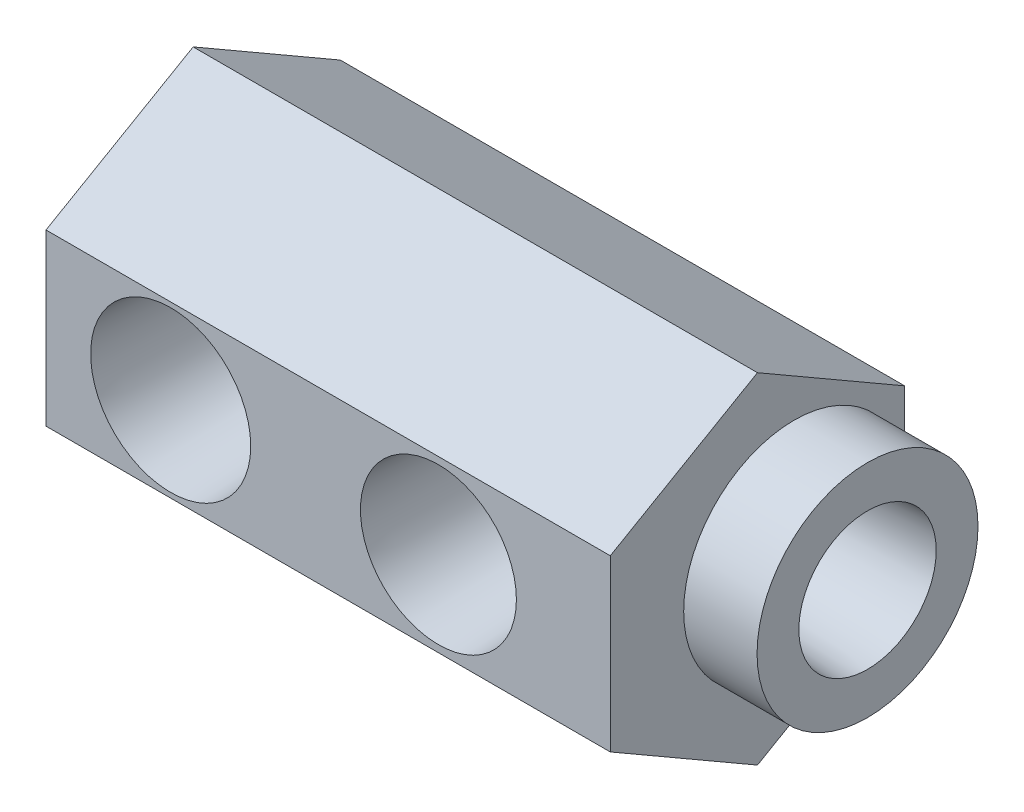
ISO-10303-21;
HEADER;
FILE_DESCRIPTION(('STEP AP214'),'2;1');
FILE_NAME('part.step','',(''),(''),'','','');
FILE_SCHEMA(('AUTOMOTIVE_DESIGN { 1 0 10303 214 1 1 1 1 }'));
ENDSEC;
DATA;
#1=APPLICATION_CONTEXT('core data for automotive mechanical design processes');
#2=APPLICATION_PROTOCOL_DEFINITION('international standard','automotive_design',2000,#1);
#3=PRODUCT_CONTEXT('',#1,'mechanical');
#4=PRODUCT('Part','Part','',(#3));
#5=PRODUCT_RELATED_PRODUCT_CATEGORY('part','',(#4));
#6=PRODUCT_DEFINITION_FORMATION('','',#4);
#7=PRODUCT_DEFINITION_CONTEXT('part definition',#1,'design');
#8=PRODUCT_DEFINITION('design','',#6,#7);
#9=PRODUCT_DEFINITION_SHAPE('','',#8);
#10=(LENGTH_UNIT() NAMED_UNIT(*) SI_UNIT(.MILLI.,.METRE.));
#11=(NAMED_UNIT(*) PLANE_ANGLE_UNIT() SI_UNIT($,.RADIAN.));
#12=(NAMED_UNIT(*) SI_UNIT($,.STERADIAN.) SOLID_ANGLE_UNIT());
#13=UNCERTAINTY_MEASURE_WITH_UNIT(LENGTH_MEASURE(1.E-05),#10,'distance_accuracy_value','');
#14=(GEOMETRIC_REPRESENTATION_CONTEXT(3) GLOBAL_UNCERTAINTY_ASSIGNED_CONTEXT((#13)) GLOBAL_UNIT_ASSIGNED_CONTEXT((#10,
#11,#12)) REPRESENTATION_CONTEXT('',''));
#15=CARTESIAN_POINT('',(0.,0.,0.));
#16=DIRECTION('',(0.,0.,1.));
#17=DIRECTION('',(1.,0.,0.));
#18=AXIS2_PLACEMENT_3D('',#15,#16,#17);
#19=CARTESIAN_POINT('',(23.270817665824,0.,7.8613));
#20=DIRECTION('',(-1.,0.,0.));
#21=DIRECTION('',(0.,0.,1.));
#22=AXIS2_PLACEMENT_3D('',#19,#20,#21);
#23=CYLINDRICAL_SURFACE('',#22,2.77749);
#24=CARTESIAN_POINT('',(21.3737276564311,-1.30506004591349,10.3130889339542));
#25=CARTESIAN_POINT('',(21.3973538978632,-1.37797775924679,10.2742739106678));
#26=CARTESIAN_POINT('',(21.4224908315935,-1.44874878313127,10.232430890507));
#27=CARTESIAN_POINT('',(21.4750745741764,-1.58567543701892,10.1431329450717));
#28=CARTESIAN_POINT('',(21.5025197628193,-1.65183424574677,10.0956819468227));
#29=CARTESIAN_POINT('',(21.5591046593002,-1.77945505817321,9.99544830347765));
#30=CARTESIAN_POINT('',(21.5882479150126,-1.84090655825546,9.94265431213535));
#31=CARTESIAN_POINT('',(21.6474375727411,-1.95874458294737,9.83216162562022));
#32=CARTESIAN_POINT('',(21.6774841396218,-2.01513017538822,9.77446203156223));
#33=CARTESIAN_POINT('',(21.7677217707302,-2.17616061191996,9.59468772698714));
#34=CARTESIAN_POINT('',(21.8281842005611,-2.27305299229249,9.4656422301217));
#35=CARTESIAN_POINT('',(21.9428710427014,-2.44395224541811,9.19083992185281));
#36=CARTESIAN_POINT('',(21.9971037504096,-2.51798977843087,9.04510586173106));
#37=CARTESIAN_POINT('',(22.0796814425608,-2.62544533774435,8.77618594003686));
#38=CARTESIAN_POINT('',(22.1111143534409,-2.66436566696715,8.65616441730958));
#39=CARTESIAN_POINT('',(22.1618277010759,-2.72578436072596,8.40959813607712));
#40=CARTESIAN_POINT('',(22.1811293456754,-2.74831139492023,8.28306518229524));
#41=CARTESIAN_POINT('',(22.2046571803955,-2.77564268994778,8.02582349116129));
#42=CARTESIAN_POINT('',(22.2087881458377,-2.78033501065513,7.8950935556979));
#43=CARTESIAN_POINT('',(22.2009412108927,-2.77129933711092,7.63474006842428));
#44=CARTESIAN_POINT('',(22.1889576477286,-2.75756486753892,7.50511692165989));
#45=CARTESIAN_POINT('',(22.1526089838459,-2.71462434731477,7.26194136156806));
#46=CARTESIAN_POINT('',(22.1293772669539,-2.68682566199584,7.14795715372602));
#47=CARTESIAN_POINT('',(22.0740109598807,-2.61797555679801,6.92634467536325));
#48=CARTESIAN_POINT('',(22.0418692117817,-2.57691347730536,6.81872159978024));
#49=CARTESIAN_POINT('',(21.9566589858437,-2.46260959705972,6.56648702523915));
#50=CARTESIAN_POINT('',(21.90051901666,-2.3831155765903,6.42573663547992));
#51=CARTESIAN_POINT('',(21.7838826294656,-2.20212847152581,6.16104768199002));
#52=CARTESIAN_POINT('',(21.7233788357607,-2.10059752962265,6.03713865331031));
#53=CARTESIAN_POINT('',(21.6038843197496,-1.87613586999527,5.80687961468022));
#54=CARTESIAN_POINT('',(21.5449135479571,-1.75301017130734,5.70070846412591));
#55=CARTESIAN_POINT('',(21.4350337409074,-1.4878197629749,5.51025941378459));
#56=CARTESIAN_POINT('',(21.3841111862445,-1.34578756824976,5.425944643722));
#57=CARTESIAN_POINT('',(21.3040506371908,-1.07395376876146,5.29629136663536));
#58=CARTESIAN_POINT('',(21.2726147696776,-0.946907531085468,5.24659928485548));
#59=CARTESIAN_POINT('',(21.2211315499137,-0.684764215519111,5.16606190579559));
#60=CARTESIAN_POINT('',(21.2010767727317,-0.549672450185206,5.13520432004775));
#61=CARTESIAN_POINT('',(21.1741457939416,-0.274541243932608,5.09390181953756));
#62=CARTESIAN_POINT('',(21.1673199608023,-0.134484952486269,5.0835349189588));
#63=CARTESIAN_POINT('',(21.1676886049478,0.145568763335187,5.08409613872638));
#64=CARTESIAN_POINT('',(21.1748824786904,0.285566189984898,5.09502334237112));
#65=CARTESIAN_POINT('',(21.2016828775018,0.552301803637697,5.13614211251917));
#66=CARTESIAN_POINT('',(21.2204809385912,0.67932035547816,5.16507988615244));
#67=CARTESIAN_POINT('',(21.2681929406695,0.926313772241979,5.23965006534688));
#68=CARTESIAN_POINT('',(21.2971085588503,1.04628746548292,5.28528523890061));
#69=CARTESIAN_POINT('',(21.3651621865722,1.28472750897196,5.39506867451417));
#70=CARTESIAN_POINT('',(21.4048550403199,1.40255500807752,5.4602519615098));
#71=CARTESIAN_POINT('',(21.4904859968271,1.62607001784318,5.6056074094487));
#72=CARTESIAN_POINT('',(21.5364283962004,1.73174908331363,5.68578989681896));
#73=CARTESIAN_POINT('',(21.6389508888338,1.94543109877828,5.87308843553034));
#74=CARTESIAN_POINT('',(21.6960698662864,2.0512038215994,5.98245607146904));
#75=CARTESIAN_POINT('',(21.8094752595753,2.24380850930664,6.21726557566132));
#76=CARTESIAN_POINT('',(21.8657612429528,2.33063093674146,6.34271548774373));
#77=CARTESIAN_POINT('',(21.9657260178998,2.47521281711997,6.59385711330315));
#78=CARTESIAN_POINT('',(22.0101102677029,2.53510884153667,6.71803133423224));
#79=CARTESIAN_POINT('',(22.0883578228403,2.63651303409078,6.97672985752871));
#80=CARTESIAN_POINT('',(22.122240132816,2.67805447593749,7.11123490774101));
#81=CARTESIAN_POINT('',(22.170107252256,2.73551154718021,7.36572216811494));
#82=CARTESIAN_POINT('',(22.1864130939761,2.75447041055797,7.48456945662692));
#83=CARTESIAN_POINT('',(22.2056351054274,2.77674613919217,7.72476031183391));
#84=CARTESIAN_POINT('',(22.2085628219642,2.78007649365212,7.84610163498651));
#85=CARTESIAN_POINT('',(22.2005850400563,2.77088844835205,8.08766420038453));
#86=CARTESIAN_POINT('',(22.1896832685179,2.75837431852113,8.2078857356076));
#87=CARTESIAN_POINT('',(22.1556999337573,2.71831489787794,8.44405710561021));
#88=CARTESIAN_POINT('',(22.1326036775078,2.69075147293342,8.56000160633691));
#89=CARTESIAN_POINT('',(22.0692046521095,2.61209857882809,8.81750514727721));
#90=CARTESIAN_POINT('',(22.0258735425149,2.55654210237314,8.9569419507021));
#91=CARTESIAN_POINT('',(21.9304193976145,2.42541298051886,9.22287733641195));
#92=CARTESIAN_POINT('',(21.8782792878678,2.349801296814,9.34935001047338));
#93=CARTESIAN_POINT('',(21.7700387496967,2.17895699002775,9.59010526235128));
#94=CARTESIAN_POINT('',(21.7138847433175,2.08340224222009,9.70413390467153));
#95=CARTESIAN_POINT('',(21.6036290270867,1.87495636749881,9.91579854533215));
#96=CARTESIAN_POINT('',(21.5495227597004,1.76210695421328,10.0134728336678));
#97=CARTESIAN_POINT('',(21.4763711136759,1.5882426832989,10.1408316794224));
#98=CARTESIAN_POINT('',(21.4546790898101,1.53364761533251,10.177927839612));
#99=CARTESIAN_POINT('',(21.4129091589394,1.42152524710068,10.2483681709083));
#100=CARTESIAN_POINT('',(21.3928308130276,1.36399875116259,10.2817133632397));
#101=CARTESIAN_POINT('',(21.3737276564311,1.30506004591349,10.3130889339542));
#102=B_SPLINE_CURVE_WITH_KNOTS('',3,(#24,#25,#26,#27,#28,#29,#30,#31,#32,#33,#34,#35,#36,#37,
#38,#39,#40,#41,#42,#43,#44,#45,#46,#47,#48,#49,#50,#51,#52,#53,#54,#55,#56,#57,#58,#59,#60,#61,
#62,#63,#64,#65,#66,#67,#68,#69,#70,#71,#72,#73,#74,#75,#76,#77,#78,#79,#80,#81,#82,#83,#84,#85,
#86,#87,#88,#89,#90,#91,#92,#93,#94,#95,#96,#97,#98,#99,#100,#101),.UNSPECIFIED.,.F.,.F.,(4,2,2,
2,2,2,2,2,2,2,2,2,2,2,2,2,2,2,2,2,2,2,2,2,2,2,2,2,2,2,2,2,2,2,2,2,2,2,4),(0.,0.257602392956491,
0.515025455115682,0.77300712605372,1.03103617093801,1.54559120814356,2.05945292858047,
2.44804168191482,2.83594920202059,3.22628745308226,3.61676290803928,3.97420041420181,
4.33192590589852,4.84261070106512,5.35417984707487,5.87063113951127,6.38620545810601,
6.80441814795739,7.22235768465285,7.64188540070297,8.06139505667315,8.45454129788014,
8.84775274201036,9.26729363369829,9.6871244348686,10.1727351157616,10.6585896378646,
11.0914742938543,11.5235709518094,11.8863017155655,12.2487193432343,12.6110393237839,
12.9737968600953,13.4399831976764,13.9070837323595,14.3824112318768,14.8566098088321,
15.0648914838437,15.2731163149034),.UNSPECIFIED.);
#103=CARTESIAN_POINT('',(21.3737276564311,-1.30506004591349,10.3130889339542));
#104=VERTEX_POINT('',#103);
#105=CARTESIAN_POINT('',(21.3737276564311,1.30506004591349,10.3130889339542));
#106=VERTEX_POINT('',#105);
#107=EDGE_CURVE('E233',#104,#106,#102,.T.);
#108=ORIENTED_EDGE('',*,*,#107,.T.);
#109=DIRECTION('',(-1.,0.,0.));
#110=VECTOR('',#109,1.);
#111=CARTESIAN_POINT('',(23.270817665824,1.30506004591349,10.3130889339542));
#112=LINE('',#111,#110);
#113=CARTESIAN_POINT('',(21.038594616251,1.30506004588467,10.3130889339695));
#114=VERTEX_POINT('',#113);
#115=EDGE_CURVE('E415',#106,#114,#112,.T.);
#116=ORIENTED_EDGE('',*,*,#115,.T.);
#117=CARTESIAN_POINT('',(21.0387179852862,1.30543571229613,10.3128889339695));
#118=CARTESIAN_POINT('',(21.019492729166,1.24692287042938,10.3440510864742));
#119=CARTESIAN_POINT('',(21.0012745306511,1.18701893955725,10.3732547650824));
#120=CARTESIAN_POINT('',(20.9671508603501,1.06467711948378,10.4275011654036));
#121=CARTESIAN_POINT('',(20.9512467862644,1.0022377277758,10.4525413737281));
#122=CARTESIAN_POINT('',(20.9220445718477,0.875016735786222,10.4982245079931));
#123=CARTESIAN_POINT('',(20.9087517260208,0.810230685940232,10.5188585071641));
#124=CARTESIAN_POINT('',(20.8850854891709,0.678854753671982,10.5554166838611));
#125=CARTESIAN_POINT('',(20.8747115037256,0.612265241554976,10.5713418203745));
#126=CARTESIAN_POINT('',(20.8482645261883,0.409877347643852,10.611820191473));
#127=CARTESIAN_POINT('',(20.8369546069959,0.271834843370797,10.6289404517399));
#128=CARTESIAN_POINT('',(20.8281737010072,-0.00542225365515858,10.6422473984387));
#129=CARTESIAN_POINT('',(20.8306800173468,-0.144634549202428,10.6384684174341));
#130=CARTESIAN_POINT('',(20.8487031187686,-0.412628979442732,10.6110939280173));
#131=CARTESIAN_POINT('',(20.8635181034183,-0.541571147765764,10.5885672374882));
#132=CARTESIAN_POINT('',(20.9040511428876,-0.793453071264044,10.5262042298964));
#133=CARTESIAN_POINT('',(20.9297721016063,-0.916391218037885,10.4863633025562));
#134=CARTESIAN_POINT('',(20.971809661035,-1.08147222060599,10.4200884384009));
#135=CARTESIAN_POINT('',(20.9843542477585,-1.12735009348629,10.4002015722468));
#136=CARTESIAN_POINT('',(21.0106547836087,-1.21754257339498,10.3581983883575));
#137=CARTESIAN_POINT('',(21.0244070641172,-1.26186137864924,10.3360887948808));
#138=CARTESIAN_POINT('',(21.0387179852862,-1.30543571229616,10.3128889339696));
#139=B_SPLINE_CURVE_WITH_KNOTS('',3,(#117,#118,#119,#120,#121,#122,#123,#124,#125,#126,#127,
#128,#129,#130,#131,#132,#133,#134,#135,#136,#137,#138),.UNSPECIFIED.,.F.,.F.,(4,2,2,2,2,2,2,2,
2,2,4),(0.,0.207046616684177,0.414217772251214,0.621804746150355,0.829349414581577,
1.24564881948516,1.66126454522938,2.0546896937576,2.44821966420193,2.60281207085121,
2.75695012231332),.UNSPECIFIED.);
#140=CARTESIAN_POINT('',(21.038594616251,-1.30506004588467,10.3130889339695));
#141=VERTEX_POINT('',#140);
#142=EDGE_CURVE('E153',#114,#141,#139,.T.);
#143=ORIENTED_EDGE('',*,*,#142,.T.);
#144=DIRECTION('',(-1.,0.,0.));
#145=VECTOR('',#144,1.);
#146=CARTESIAN_POINT('',(23.270817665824,-1.30506004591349,10.3130889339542));
#147=LINE('',#146,#145);
#148=EDGE_CURVE('E242',#141,#104,#147,.F.);
#149=ORIENTED_EDGE('',*,*,#148,.T.);
#150=EDGE_LOOP('',(#108,#116,#143,#149));
#151=FACE_BOUND('',#150,.T.);
#152=CARTESIAN_POINT('',(12.5274300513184,1.43384481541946,10.2400685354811));
#153=CARTESIAN_POINT('',(12.5479920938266,1.37592457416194,10.2749847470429));
#154=CARTESIAN_POINT('',(12.5676548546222,1.31647816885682,10.3079286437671));
#155=CARTESIAN_POINT('',(12.6048538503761,1.19475837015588,10.369617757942));
#156=CARTESIAN_POINT('',(12.622388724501,1.13248320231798,10.3983602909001));
#157=CARTESIAN_POINT('',(12.6550303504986,1.00519737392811,10.4514343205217));
#158=CARTESIAN_POINT('',(12.6701289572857,0.940178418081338,10.4757510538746));
#159=CARTESIAN_POINT('',(12.6975140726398,0.807998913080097,10.5195786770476));
#160=CARTESIAN_POINT('',(12.7098011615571,0.740838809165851,10.5390905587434));
#161=CARTESIAN_POINT('',(12.7421047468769,0.536164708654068,10.5901711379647));
#162=CARTESIAN_POINT('',(12.7574561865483,0.39586549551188,10.6141128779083));
#163=CARTESIAN_POINT('',(12.7741473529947,0.112797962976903,10.6401292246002));
#164=CARTESIAN_POINT('',(12.775520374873,-0.0299636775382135,10.6422557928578));
#165=CARTESIAN_POINT('',(12.7646045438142,-0.30439107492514,10.6252600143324));
#166=CARTESIAN_POINT('',(12.7531897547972,-0.436179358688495,10.6074971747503));
#167=CARTESIAN_POINT('',(12.7190336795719,-0.694653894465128,10.5537624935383));
#168=CARTESIAN_POINT('',(12.6962758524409,-0.821332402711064,10.5177640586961));
#169=CARTESIAN_POINT('',(12.6493659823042,-1.03022461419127,10.4422968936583));
#170=CARTESIAN_POINT('',(12.6276054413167,-1.11453183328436,10.4069841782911));
#171=CARTESIAN_POINT('',(12.580223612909,-1.27805003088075,10.3289335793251));
#172=CARTESIAN_POINT('',(12.5546186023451,-1.35728057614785,10.2862268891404));
#173=CARTESIAN_POINT('',(12.5274300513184,-1.43384481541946,10.2400685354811));
#174=B_SPLINE_CURVE_WITH_KNOTS('',3,(#152,#153,#154,#155,#156,#157,#158,#159,#160,#161,#162,
#163,#164,#165,#166,#167,#168,#169,#170,#171,#172,#173),.UNSPECIFIED.,.F.,.F.,(4,2,2,2,2,2,2,2,
2,2,4),(0.,0.212033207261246,0.424201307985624,0.637064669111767,0.849884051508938,
1.27687316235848,1.70284499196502,2.10138633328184,2.50051055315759,2.78190098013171,
3.06213199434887),.UNSPECIFIED.);
#175=CARTESIAN_POINT('',(12.5275478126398,1.43351296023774,10.2402685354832));
#176=VERTEX_POINT('',#175);
#177=CARTESIAN_POINT('',(12.5275478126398,-1.43351296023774,10.2402685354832));
#178=VERTEX_POINT('',#177);
#179=EDGE_CURVE('E10',#176,#178,#174,.T.);
#180=ORIENTED_EDGE('',*,*,#179,.F.);
#181=DIRECTION('',(-1.,0.,0.));
#182=VECTOR('',#181,1.);
#183=CARTESIAN_POINT('',(23.270817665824,1.43351296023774,10.2402685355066));
#184=LINE('',#183,#182);
#185=CARTESIAN_POINT('',(12.3190000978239,1.43351296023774,10.2402685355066));
#186=VERTEX_POINT('',#185);
#187=EDGE_CURVE('E336',#176,#186,#184,.T.);
#188=ORIENTED_EDGE('',*,*,#187,.T.);
#189=CARTESIAN_POINT('',(12.3190000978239,0.,7.8613));
#190=DIRECTION('',(1.,0.,0.));
#191=DIRECTION('',(0.,0.,-1.));
#192=AXIS2_PLACEMENT_3D('',#189,#190,#191);
#193=CIRCLE('',#192,2.77749);
#194=CARTESIAN_POINT('',(12.3190000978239,1.00498568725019,5.27200386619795));
#195=VERTEX_POINT('',#194);
#196=EDGE_CURVE('E416',#195,#186,#193,.T.);
#197=ORIENTED_EDGE('',*,*,#196,.F.);
#198=CARTESIAN_POINT('',(12.3190000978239,1.00498568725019,5.27200386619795));
#199=CARTESIAN_POINT('',(12.3335976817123,0.943314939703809,5.24805992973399));
#200=CARTESIAN_POINT('',(12.3470227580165,0.880531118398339,5.22623478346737));
#201=CARTESIAN_POINT('',(12.3712936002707,0.75307890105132,5.18702240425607));
#202=CARTESIAN_POINT('',(12.3821382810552,0.688409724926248,5.16963703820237));
#203=CARTESIAN_POINT('',(12.400991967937,0.55764603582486,5.13954002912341));
#204=CARTESIAN_POINT('',(12.4090037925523,0.491553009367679,5.12682374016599));
#205=CARTESIAN_POINT('',(12.422033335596,0.358358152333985,5.10619942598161));
#206=CARTESIAN_POINT('',(12.4270515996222,0.291256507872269,5.09829052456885));
#207=CARTESIAN_POINT('',(12.4374370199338,0.088712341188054,5.08192837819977));
#208=CARTESIAN_POINT('',(12.4380925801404,-0.0476817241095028,5.08090626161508));
#209=CARTESIAN_POINT('',(12.4267286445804,-0.318452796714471,5.09879302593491));
#210=CARTESIAN_POINT('',(12.4147211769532,-0.452831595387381,5.11768299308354));
#211=CARTESIAN_POINT('',(12.3872238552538,-0.656507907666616,5.16149863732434));
#212=CARTESIAN_POINT('',(12.3757400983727,-0.727850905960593,5.17987091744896));
#213=CARTESIAN_POINT('',(12.3496397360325,-0.868226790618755,5.22198300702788));
#214=CARTESIAN_POINT('',(12.3350279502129,-0.937263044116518,5.24571456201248));
#215=CARTESIAN_POINT('',(12.3190000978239,-1.00498568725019,5.27200386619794));
#216=B_SPLINE_CURVE_WITH_KNOTS('',3,(#198,#199,#200,#201,#202,#203,#204,#205,#206,#207,#208,
#209,#210,#211,#212,#213,#214,#215),.UNSPECIFIED.,.F.,.F.,(4,2,2,2,2,2,2,2,4),(0.,
0.20320627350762,0.406497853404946,0.609586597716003,0.812638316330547,1.21962478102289,
1.62622501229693,1.84964150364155,2.07271620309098),.UNSPECIFIED.);
#217=CARTESIAN_POINT('',(12.3190000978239,-1.00498568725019,5.27200386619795));
#218=VERTEX_POINT('',#217);
#219=EDGE_CURVE('E201',#195,#218,#216,.T.);
#220=ORIENTED_EDGE('',*,*,#219,.T.);
#221=CARTESIAN_POINT('',(12.3190000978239,-1.43351296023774,10.2402685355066));
#222=VERTEX_POINT('',#221);
#223=EDGE_CURVE('E414',#222,#218,#193,.T.);
#224=ORIENTED_EDGE('',*,*,#223,.F.);
#225=DIRECTION('',(-1.,0.,0.));
#226=VECTOR('',#225,1.);
#227=CARTESIAN_POINT('',(23.270817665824,-1.43351296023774,10.2402685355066));
#228=LINE('',#227,#226);
#229=EDGE_CURVE('E30',#222,#178,#228,.F.);
#230=ORIENTED_EDGE('',*,*,#229,.T.);
#231=EDGE_LOOP('',(#180,#188,#197,#220,#224,#230));
#232=FACE_BOUND('',#231,.T.);
#233=ADVANCED_FACE('F16',(#151,#232),#23,.F.);
#234=CARTESIAN_POINT('',(12.3190000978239,0.,5.64018875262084));
#235=DIRECTION('',(1.,0.,0.));
#236=DIRECTION('',(0.,0.,-1.));
#237=AXIS2_PLACEMENT_3D('',#234,#235,#236);
#238=PLANE('',#237);
#239=DIRECTION('',(0.,1.,0.));
#240=VECTOR('',#239,1.);
#241=CARTESIAN_POINT('',(12.3190000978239,0.,10.2402685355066));
#242=LINE('',#241,#240);
#243=CARTESIAN_POINT('',(12.3190000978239,-1.00498568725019,10.2402685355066));
#244=VERTEX_POINT('',#243);
#245=EDGE_CURVE('E455',#222,#244,#242,.T.);
#246=ORIENTED_EDGE('',*,*,#245,.F.);
#247=ORIENTED_EDGE('',*,*,#223,.T.);
#248=DIRECTION('',(0.,0.,1.));
#249=VECTOR('',#248,1.);
#250=CARTESIAN_POINT('',(12.3190000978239,-1.00498568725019,34.3708220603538));
#251=LINE('',#250,#249);
#252=CARTESIAN_POINT('',(12.3190000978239,-1.00498568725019,6.83587636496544));
#253=VERTEX_POINT('',#252);
#254=EDGE_CURVE('E211',#253,#218,#251,.F.);
#255=ORIENTED_EDGE('',*,*,#254,.F.);
#256=CARTESIAN_POINT('',(12.3190000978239,0.,7.8613));
#257=DIRECTION('',(1.,0.,0.));
#258=DIRECTION('',(0.,0.,-1.));
#259=AXIS2_PLACEMENT_3D('',#256,#257,#258);
#260=CIRCLE('',#259,1.43578893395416);
#261=CARTESIAN_POINT('',(12.3190000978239,-1.0049856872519,8.88672363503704));
#262=VERTEX_POINT('',#261);
#263=EDGE_CURVE('E241',#253,#262,#260,.F.);
#264=ORIENTED_EDGE('',*,*,#263,.T.);
#265=EDGE_CURVE('E210',#244,#262,#251,.F.);
#266=ORIENTED_EDGE('',*,*,#265,.F.);
#267=EDGE_LOOP('',(#246,#247,#255,#264,#266));
#268=FACE_BOUND('',#267,.T.);
#269=ADVANCED_FACE('F18',(#268),#238,.T.);
#270=CARTESIAN_POINT('',(12.3190000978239,1.00498568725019,10.2402685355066));
#271=VERTEX_POINT('',#270);
#272=EDGE_CURVE('E209',#271,#186,#242,.T.);
#273=ORIENTED_EDGE('',*,*,#272,.F.);
#274=DIRECTION('',(0.,0.,1.));
#275=VECTOR('',#274,1.);
#276=CARTESIAN_POINT('',(12.3190000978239,1.00498568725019,34.3708220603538));
#277=LINE('',#276,#275);
#278=CARTESIAN_POINT('',(12.3190000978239,1.00498568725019,8.88672363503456));
#279=VERTEX_POINT('',#278);
#280=EDGE_CURVE('E424',#279,#271,#277,.T.);
#281=ORIENTED_EDGE('',*,*,#280,.F.);
#282=CARTESIAN_POINT('',(12.3190000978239,1.0049856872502,6.83587636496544));
#283=VERTEX_POINT('',#282);
#284=EDGE_CURVE('E423',#279,#283,#260,.F.);
#285=ORIENTED_EDGE('',*,*,#284,.T.);
#286=EDGE_CURVE('E426',#195,#283,#277,.T.);
#287=ORIENTED_EDGE('',*,*,#286,.F.);
#288=ORIENTED_EDGE('',*,*,#196,.T.);
#289=EDGE_LOOP('',(#273,#281,#285,#287,#288));
#290=FACE_BOUND('',#289,.T.);
#291=ADVANCED_FACE('F193',(#290),#238,.T.);
#292=CARTESIAN_POINT('',(8.07062565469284,0.,34.3708220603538));
#293=DIRECTION('',(0.,0.,1.));
#294=DIRECTION('',(1.,0.,0.));
#295=AXIS2_PLACEMENT_3D('',#292,#293,#294);
#296=CYLINDRICAL_SURFACE('',#295,4.36562500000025);
#297=CARTESIAN_POINT('',(8.07062565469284,0.,5.02988893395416));
#298=DIRECTION('',(0.,0.,1.));
#299=DIRECTION('',(1.,0.,0.));
#300=AXIS2_PLACEMENT_3D('',#297,#298,#299);
#301=CIRCLE('',#300,4.36562500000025);
#302=CARTESIAN_POINT('',(12.4362506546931,0.,5.02988893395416));
#303=VERTEX_POINT('',#302);
#304=EDGE_CURVE('E181',#303,#303,#301,.T.);
#305=ORIENTED_EDGE('',*,*,#304,.F.);
#306=EDGE_LOOP('',(#305));
#307=FACE_BOUND('',#306,.T.);
#308=ORIENTED_EDGE('',*,*,#219,.F.);
#309=ORIENTED_EDGE('',*,*,#286,.T.);
#310=CARTESIAN_POINT('',(12.4362506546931,0.,9.29708893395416));
#311=CARTESIAN_POINT('',(12.4362507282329,0.078400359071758,9.29708909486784));
#312=CARTESIAN_POINT('',(12.4341191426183,0.15680018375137,9.2906464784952));
#313=CARTESIAN_POINT('',(12.4258255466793,0.311294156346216,9.26512262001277));
#314=CARTESIAN_POINT('',(12.4196630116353,0.387388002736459,9.2460397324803));
#315=CARTESIAN_POINT('',(12.4039779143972,0.535020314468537,9.19595769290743));
#316=CARTESIAN_POINT('',(12.3944608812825,0.606566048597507,9.16497814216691));
#317=CARTESIAN_POINT('',(12.3730406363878,0.743446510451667,9.09206963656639));
#318=CARTESIAN_POINT('',(12.3611369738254,0.808780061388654,9.05013861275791));
#319=CARTESIAN_POINT('',(12.3357482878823,0.93359134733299,8.95502724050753));
#320=CARTESIAN_POINT('',(12.3222261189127,0.99282984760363,8.90154292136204));
#321=CARTESIAN_POINT('',(12.2953311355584,1.10167823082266,8.78548965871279));
#322=CARTESIAN_POINT('',(12.2819583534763,1.15128606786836,8.72291878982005));
#323=CARTESIAN_POINT('',(12.2564697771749,1.24081551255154,8.58833292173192));
#324=CARTESIAN_POINT('',(12.2443993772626,1.28042878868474,8.51610339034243));
#325=CARTESIAN_POINT('',(12.2234456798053,1.34684415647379,8.36554636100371));
#326=CARTESIAN_POINT('',(12.2145614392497,1.37365003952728,8.28722067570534));
#327=CARTESIAN_POINT('',(12.2013765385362,1.41279703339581,8.12941074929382));
#328=CARTESIAN_POINT('',(12.196934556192,1.42558546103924,8.05004962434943));
#329=CARTESIAN_POINT('',(12.192718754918,1.43773271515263,7.89019337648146));
#330=CARTESIAN_POINT('',(12.1929435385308,1.43709556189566,7.80969860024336));
#331=CARTESIAN_POINT('',(12.1979118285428,1.42275760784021,7.65364950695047));
#332=CARTESIAN_POINT('',(12.202454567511,1.40963720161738,7.57803436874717));
#333=CARTESIAN_POINT('',(12.2152189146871,1.37165073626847,7.43014498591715));
#334=CARTESIAN_POINT('',(12.2234409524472,1.34678330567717,7.35787113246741));
#335=CARTESIAN_POINT('',(12.24278287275,1.28562229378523,7.21738336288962));
#336=CARTESIAN_POINT('',(12.2539464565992,1.24915451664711,7.14925155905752));
#337=CARTESIAN_POINT('',(12.2778949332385,1.16594893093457,7.01988946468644));
#338=CARTESIAN_POINT('',(12.2906802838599,1.11920821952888,6.95866113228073));
#339=CARTESIAN_POINT('',(12.3172249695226,1.01398285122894,6.84157825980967));
#340=CARTESIAN_POINT('',(12.3310008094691,0.955022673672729,6.7861539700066));
#341=CARTESIAN_POINT('',(12.3574058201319,0.828474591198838,6.68586900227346));
#342=CARTESIAN_POINT('',(12.3700348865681,0.760885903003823,6.64100928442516));
#343=CARTESIAN_POINT('',(12.3928816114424,0.618105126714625,6.56279264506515));
#344=CARTESIAN_POINT('',(12.4030753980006,0.542847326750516,6.52954822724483));
#345=CARTESIAN_POINT('',(12.4197299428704,0.387392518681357,6.47632335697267));
#346=CARTESIAN_POINT('',(12.4261919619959,0.307197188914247,6.45633842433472));
#347=CARTESIAN_POINT('',(12.4344473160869,0.147788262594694,6.43095563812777));
#348=CARTESIAN_POINT('',(12.4364266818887,0.068676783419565,6.42497617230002));
#349=CARTESIAN_POINT('',(12.4360499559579,-0.0894331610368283,6.4261209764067));
#350=CARTESIAN_POINT('',(12.4336945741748,-0.168431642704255,6.43324310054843));
#351=CARTESIAN_POINT('',(12.4250356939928,-0.321763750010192,6.45992716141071));
#352=CARTESIAN_POINT('',(12.4188448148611,-0.396166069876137,6.47913449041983));
#353=CARTESIAN_POINT('',(12.4032518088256,-0.540664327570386,6.52900271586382));
#354=CARTESIAN_POINT('',(12.3938492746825,-0.61075971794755,6.55966506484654));
#355=CARTESIAN_POINT('',(12.3724871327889,-0.74667791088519,6.63245544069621));
#356=CARTESIAN_POINT('',(12.3604675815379,-0.8123429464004,6.6748599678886));
#357=CARTESIAN_POINT('',(12.3352368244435,-0.935815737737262,6.76960468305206));
#358=CARTESIAN_POINT('',(12.3220252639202,-0.99362114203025,6.82194783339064));
#359=CARTESIAN_POINT('',(12.2951609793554,-1.10238929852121,6.93781969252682));
#360=CARTESIAN_POINT('',(12.2815145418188,-1.15293708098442,7.00174032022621));
#361=CARTESIAN_POINT('',(12.2559234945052,-1.24263696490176,7.1374505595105));
#362=CARTESIAN_POINT('',(12.2439788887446,-1.28178903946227,7.20924018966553));
#363=CARTESIAN_POINT('',(12.223264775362,-1.34738912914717,7.3586383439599));
#364=CARTESIAN_POINT('',(12.2144874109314,-1.3738686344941,7.43623188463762));
#365=CARTESIAN_POINT('',(12.2012171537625,-1.41327145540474,7.59513040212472));
#366=CARTESIAN_POINT('',(12.1967223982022,-1.42620066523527,7.67643374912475));
#367=CARTESIAN_POINT('',(12.1927343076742,-1.43768386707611,7.83606759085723));
#368=CARTESIAN_POINT('',(12.1930019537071,-1.43692482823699,7.91434326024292));
#369=CARTESIAN_POINT('',(12.1979197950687,-1.4227367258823,8.06959033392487));
#370=CARTESIAN_POINT('',(12.2025697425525,-1.40930837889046,8.14656181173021));
#371=CARTESIAN_POINT('',(12.2155526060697,-1.37064355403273,8.29564122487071));
#372=CARTESIAN_POINT('',(12.2238177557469,-1.34562386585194,8.36781174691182));
#373=CARTESIAN_POINT('',(12.2430763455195,-1.28466103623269,8.50698649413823));
#374=CARTESIAN_POINT('',(12.2540703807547,-1.24871551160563,8.57398958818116));
#375=CARTESIAN_POINT('',(12.2781329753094,-1.16513062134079,8.70402570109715));
#376=CARTESIAN_POINT('',(12.2912700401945,-1.11705770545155,8.76676729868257));
#377=CARTESIAN_POINT('',(12.3178455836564,-1.01132208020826,8.88351497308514));
#378=CARTESIAN_POINT('',(12.3312841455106,-0.953656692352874,8.93751860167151));
#379=CARTESIAN_POINT('',(12.3575543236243,-0.827771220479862,9.03729866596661));
#380=CARTESIAN_POINT('',(12.3703441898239,-0.759236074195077,9.08268994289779));
#381=CARTESIAN_POINT('',(12.3933168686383,-0.615091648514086,9.16125548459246));
#382=CARTESIAN_POINT('',(12.4035004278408,-0.539484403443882,9.19443324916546));
#383=CARTESIAN_POINT('',(12.4196539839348,-0.387501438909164,9.24601076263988));
#384=CARTESIAN_POINT('',(12.4258199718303,-0.311382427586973,9.26510514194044));
#385=CARTESIAN_POINT('',(12.4341177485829,-0.156841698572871,9.29064251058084));
#386=CARTESIAN_POINT('',(12.4362505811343,-0.0784205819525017,9.29708877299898));
#387=CARTESIAN_POINT('',(12.4362506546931,0.,9.29708893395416));
#388=B_SPLINE_CURVE_WITH_KNOTS('',3,(#310,#311,#312,#313,#314,#315,#316,#317,#318,#319,#320,
#321,#322,#323,#324,#325,#326,#327,#328,#329,#330,#331,#332,#333,#334,#335,#336,#337,#338,#339,
#340,#341,#342,#343,#344,#345,#346,#347,#348,#349,#350,#351,#352,#353,#354,#355,#356,#357,#358,
#359,#360,#361,#362,#363,#364,#365,#366,#367,#368,#369,#370,#371,#372,#373,#374,#375,#376,#377,
#378,#379,#380,#381,#382,#383,#384,#385,#386,#387),.UNSPECIFIED.,.T.,.F.,(4,2,2,2,2,2,2,2,2,2,2,
2,2,2,2,2,2,2,2,2,2,2,2,2,2,2,2,2,2,2,2,2,2,2,2,2,2,2,4),(0.,0.234912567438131,
0.469855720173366,0.704413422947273,0.939015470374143,1.18076944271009,1.4225747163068,
1.6711160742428,1.91958381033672,2.15986833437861,2.40008090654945,2.62964428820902,
2.85923447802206,3.09244939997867,3.32573030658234,3.57084685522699,3.81598567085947,
4.06343700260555,4.31080468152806,4.54770223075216,4.78456098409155,5.01477460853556,
5.24501743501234,5.48122606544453,5.71750521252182,5.96421986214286,6.21093509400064,
6.45703403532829,6.70302588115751,6.93670814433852,7.17037719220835,7.39984224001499,
7.62935737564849,7.86866648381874,8.10804252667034,8.3564087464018,8.60470374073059,
8.83973773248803,9.07471089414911),.UNSPECIFIED.);
#389=EDGE_CURVE('E180',#279,#283,#388,.T.);
#390=ORIENTED_EDGE('',*,*,#389,.F.);
#391=ORIENTED_EDGE('',*,*,#280,.T.);
#392=CARTESIAN_POINT('',(8.07062565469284,0.,10.2402685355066));
#393=DIRECTION('',(0.,0.,1.));
#394=DIRECTION('',(1.,0.,0.));
#395=AXIS2_PLACEMENT_3D('',#392,#393,#394);
#396=CIRCLE('',#395,4.36562500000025);
#397=EDGE_CURVE('E159',#271,#244,#396,.T.);
#398=ORIENTED_EDGE('',*,*,#397,.T.);
#399=ORIENTED_EDGE('',*,*,#265,.T.);
#400=EDGE_CURVE('E172',#253,#262,#388,.T.);
#401=ORIENTED_EDGE('',*,*,#400,.F.);
#402=ORIENTED_EDGE('',*,*,#254,.T.);
#403=EDGE_LOOP('',(#308,#309,#390,#391,#398,#399,#401,#402));
#404=FACE_BOUND('',#403,.T.);
#405=ADVANCED_FACE('F187',(#307,#404),#296,.F.);
#406=CARTESIAN_POINT('',(1.94544614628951,0.,7.8613));
#407=DIRECTION('',(1.,0.,0.));
#408=DIRECTION('',(0.,0.,-1.));
#409=AXIS2_PLACEMENT_3D('',#406,#407,#408);
#410=CYLINDRICAL_SURFACE('',#409,1.43578893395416);
#411=ORIENTED_EDGE('',*,*,#389,.T.);
#412=ORIENTED_EDGE('',*,*,#284,.F.);
#413=EDGE_LOOP('',(#411,#412));
#414=FACE_BOUND('',#413,.T.);
#415=ADVANCED_FACE('F192',(#414),#410,.F.);
#416=CARTESIAN_POINT('',(29.6324993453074,0.,10.3130889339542));
#417=DIRECTION('',(0.,0.,-1.));
#418=DIRECTION('',(-1.,0.,0.));
#419=AXIS2_PLACEMENT_3D('',#416,#417,#418);
#420=PLANE('',#419);
#421=CARTESIAN_POINT('',(25.4,0.,10.3130889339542));
#422=DIRECTION('',(0.,0.,1.));
#423=DIRECTION('',(1.,0.,0.));
#424=AXIS2_PLACEMENT_3D('',#421,#422,#423);
#425=CIRCLE('',#424,4.23249934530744);
#426=CARTESIAN_POINT('',(28.9006019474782,2.37904113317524,10.3130889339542));
#427=VERTEX_POINT('',#426);
#428=EDGE_CURVE('E148',#427,#106,#425,.T.);
#429=ORIENTED_EDGE('',*,*,#428,.F.);
#430=DIRECTION('',(1.,0.,0.));
#431=VECTOR('',#430,1.);
#432=CARTESIAN_POINT('',(26.1149606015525,2.37904113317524,10.3130889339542));
#433=LINE('',#432,#431);
#434=CARTESIAN_POINT('',(29.2813917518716,2.37904113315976,10.3130889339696));
#435=VERTEX_POINT('',#434);
#436=EDGE_CURVE('E132',#427,#435,#433,.T.);
#437=ORIENTED_EDGE('',*,*,#436,.T.);
#438=CARTESIAN_POINT('',(25.4,0.,10.3130889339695));
#439=DIRECTION('',(0.,0.,1.));
#440=DIRECTION('',(1.,0.,0.));
#441=AXIS2_PLACEMENT_3D('',#438,#439,#440);
#442=CIRCLE('',#441,4.55247610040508);
#443=EDGE_CURVE('E146',#435,#114,#442,.T.);
#444=ORIENTED_EDGE('',*,*,#443,.T.);
#445=ORIENTED_EDGE('',*,*,#115,.F.);
#446=EDGE_LOOP('',(#429,#437,#444,#445));
#447=FACE_BOUND('',#446,.T.);
#448=ADVANCED_FACE('F144',(#447),#420,.F.);
#449=CARTESIAN_POINT('',(25.4,0.,30.402910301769));
#450=DIRECTION('',(0.,0.,1.));
#451=DIRECTION('',(1.,0.,0.));
#452=AXIS2_PLACEMENT_3D('',#449,#450,#451);
#453=CYLINDRICAL_SURFACE('',#452,4.23249934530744);
#454=CARTESIAN_POINT('',(25.4,0.,4.01388893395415));
#455=DIRECTION('',(0.,0.,1.));
#456=DIRECTION('',(1.,0.,0.));
#457=AXIS2_PLACEMENT_3D('',#454,#455,#456);
#458=CIRCLE('',#457,4.23249934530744);
#459=CARTESIAN_POINT('',(29.6324993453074,0.,4.01388893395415));
#460=VERTEX_POINT('',#459);
#461=EDGE_CURVE('E444',#460,#460,#458,.T.);
#462=ORIENTED_EDGE('',*,*,#461,.F.);
#463=EDGE_LOOP('',(#462));
#464=FACE_BOUND('',#463,.T.);
#465=CARTESIAN_POINT('',(28.9006019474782,-2.37904113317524,10.3130889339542));
#466=VERTEX_POINT('',#465);
#467=EDGE_CURVE('E166',#104,#466,#425,.T.);
#468=ORIENTED_EDGE('',*,*,#467,.T.);
#469=CARTESIAN_POINT('',(28.9006019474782,-2.37904113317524,10.3130889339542));
#470=CARTESIAN_POINT('',(28.8512381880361,-2.45170059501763,10.2425488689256));
#471=CARTESIAN_POINT('',(28.8008880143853,-2.52089901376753,10.169165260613));
#472=CARTESIAN_POINT('',(28.6993711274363,-2.65237173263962,10.0168070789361));
#473=CARTESIAN_POINT('',(28.6482036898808,-2.71463945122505,9.93782730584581));
#474=CARTESIAN_POINT('',(28.5456056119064,-2.83291916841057,9.77338370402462));
#475=CARTESIAN_POINT('',(28.4941810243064,-2.88883339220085,9.68784565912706));
#476=CARTESIAN_POINT('',(28.393347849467,-2.99318964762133,9.51127957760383));
#477=CARTESIAN_POINT('',(28.3439381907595,-3.04163568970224,9.42025452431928));
#478=CARTESIAN_POINT('',(28.2332307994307,-3.14552587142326,9.20142291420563));
#479=CARTESIAN_POINT('',(28.1734070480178,-3.19798392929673,9.07140947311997));
#480=CARTESIAN_POINT('',(28.0668015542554,-3.28740989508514,8.80156043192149));
#481=CARTESIAN_POINT('',(28.0199597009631,-3.32444961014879,8.66177398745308));
#482=CARTESIAN_POINT('',(27.9545274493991,-3.37487633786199,8.40412355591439));
#483=CARTESIAN_POINT('',(27.932042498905,-3.39162297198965,8.28794187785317));
#484=CARTESIAN_POINT('',(27.903187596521,-3.41298286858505,8.05252723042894));
#485=CARTESIAN_POINT('',(27.8967964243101,-3.41761210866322,7.93329848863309));
#486=CARTESIAN_POINT('',(27.9012655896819,-3.41434068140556,7.69525974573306));
#487=CARTESIAN_POINT('',(27.9121400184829,-3.40642977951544,7.57645016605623));
#488=CARTESIAN_POINT('',(27.9492288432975,-3.3787561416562,7.34261081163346));
#489=CARTESIAN_POINT('',(27.975470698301,-3.35897218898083,7.22758819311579));
#490=CARTESIAN_POINT('',(28.0537015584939,-3.29777248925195,6.95398958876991));
#491=CARTESIAN_POINT('',(28.1119391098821,-3.25066857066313,6.79852335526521));
#492=CARTESIAN_POINT('',(28.2419512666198,-3.13764141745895,6.50045969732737));
#493=CARTESIAN_POINT('',(28.3137705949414,-3.07165562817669,6.35790715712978));
#494=CARTESIAN_POINT('',(28.4402190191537,-2.94558877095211,6.12748529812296));
#495=CARTESIAN_POINT('',(28.4933324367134,-2.88994512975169,6.03629322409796));
#496=CARTESIAN_POINT('',(28.6005931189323,-2.77068239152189,5.8598568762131));
#497=CARTESIAN_POINT('',(28.6547407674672,-2.70706028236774,5.77461486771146));
#498=CARTESIAN_POINT('',(28.7624507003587,-2.57204758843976,5.61030800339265));
#499=CARTESIAN_POINT('',(28.8160135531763,-2.50066545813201,5.53123658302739));
#500=CARTESIAN_POINT('',(28.9212691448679,-2.35013979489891,5.37949151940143));
#501=CARTESIAN_POINT('',(28.972961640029,-2.27099525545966,5.30681870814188));
#502=CARTESIAN_POINT('',(29.103273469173,-2.05519964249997,5.12686325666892));
#503=CARTESIAN_POINT('',(29.1794765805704,-1.91249724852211,5.02492152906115));
#504=CARTESIAN_POINT('',(29.3185292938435,-1.60842714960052,4.84212431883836));
#505=CARTESIAN_POINT('',(29.3813999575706,-1.44708951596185,4.76123553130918));
#506=CARTESIAN_POINT('',(29.4798480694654,-1.13619057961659,4.63586121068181));
#507=CARTESIAN_POINT('',(29.5182139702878,-0.989057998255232,4.5875761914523));
#508=CARTESIAN_POINT('',(29.579294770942,-0.686517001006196,4.51106190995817));
#509=CARTESIAN_POINT('',(29.6020182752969,-0.531113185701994,4.48282162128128));
#510=CARTESIAN_POINT('',(29.629971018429,-0.215719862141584,4.44811706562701));
#511=CARTESIAN_POINT('',(29.6351366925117,-0.0557158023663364,4.44173192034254));
#512=CARTESIAN_POINT('',(29.6273198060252,0.26315939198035,4.45141788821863));
#513=CARTESIAN_POINT('',(29.6143368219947,0.422030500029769,4.46748952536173));
#514=CARTESIAN_POINT('',(29.5726364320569,0.724686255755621,4.51941883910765));
#515=CARTESIAN_POINT('',(29.5448673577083,0.868812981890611,4.55408483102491));
#516=CARTESIAN_POINT('',(29.4762399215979,1.14851147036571,4.64051204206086));
#517=CARTESIAN_POINT('',(29.4353782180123,1.28408103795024,4.69227762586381));
#518=CARTESIAN_POINT('',(29.3386888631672,1.55680376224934,4.81630765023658));
#519=CARTESIAN_POINT('',(29.2818166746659,1.69291183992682,4.89003979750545));
#520=CARTESIAN_POINT('',(29.1587395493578,1.95100136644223,5.05274019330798));
#521=CARTESIAN_POINT('',(29.0925297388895,2.07297537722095,5.14171640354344));
#522=CARTESIAN_POINT('',(28.9397930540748,2.32594127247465,5.35260336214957));
#523=CARTESIAN_POINT('',(28.8518943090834,2.45359252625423,5.47752080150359));
#524=CARTESIAN_POINT('',(28.6731859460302,2.68737026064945,5.74453206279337));
#525=CARTESIAN_POINT('',(28.5823726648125,2.79346831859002,5.88664817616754));
#526=CARTESIAN_POINT('',(28.4114964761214,2.97647812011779,6.17640178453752));
#527=CARTESIAN_POINT('',(28.3311336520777,3.05495999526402,6.3228693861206));
#528=CARTESIAN_POINT('',(28.1819950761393,3.19134796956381,6.63060440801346));
#529=CARTESIAN_POINT('',(28.1131948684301,3.24929779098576,6.79183944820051));
#530=CARTESIAN_POINT('',(28.0172783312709,3.3266254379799,7.07473169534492));
#531=CARTESIAN_POINT('',(27.9838719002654,3.35241429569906,7.19244954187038));
#532=CARTESIAN_POINT('',(27.9323123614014,3.39153568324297,7.4330808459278));
#533=CARTESIAN_POINT('',(27.9141224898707,3.40489824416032,7.55598102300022));
#534=CARTESIAN_POINT('',(27.8961375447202,3.41811411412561,7.80478283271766));
#535=CARTESIAN_POINT('',(27.896469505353,3.4178741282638,7.93069927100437));
#536=CARTESIAN_POINT('',(27.9157806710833,3.40367635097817,8.18032306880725));
#537=CARTESIAN_POINT('',(27.9347790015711,3.38970448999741,8.30402803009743));
#538=CARTESIAN_POINT('',(27.994137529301,3.34457069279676,8.57390005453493));
#539=CARTESIAN_POINT('',(28.0384305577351,3.3101731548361,8.71862157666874));
#540=CARTESIAN_POINT('',(28.1419617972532,3.22493056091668,8.99818102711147));
#541=CARTESIAN_POINT('',(28.2012913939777,3.17398437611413,9.13295176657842));
#542=CARTESIAN_POINT('',(28.3139172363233,3.07044823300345,9.36318075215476));
#543=CARTESIAN_POINT('',(28.3656432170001,3.02071689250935,9.46073877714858));
#544=CARTESIAN_POINT('',(28.4716756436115,2.91283042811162,9.64969813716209));
#545=CARTESIAN_POINT('',(28.5259838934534,2.85466935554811,9.74109505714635));
#546=CARTESIAN_POINT('',(28.6342969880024,2.73129807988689,9.9161451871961));
#547=CARTESIAN_POINT('',(28.6882900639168,2.66623156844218,9.99990717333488));
#548=CARTESIAN_POINT('',(28.7954229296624,2.52839867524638,10.1611880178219));
#549=CARTESIAN_POINT('',(28.8485637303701,2.45564233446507,10.2387147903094));
#550=CARTESIAN_POINT('',(28.9006019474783,2.37904113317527,10.3130889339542));
#551=B_SPLINE_CURVE_WITH_KNOTS('',3,(#469,#470,#471,#472,#473,#474,#475,#476,#477,#478,#479,
#480,#481,#482,#483,#484,#485,#486,#487,#488,#489,#490,#491,#492,#493,#494,#495,#496,#497,#498,
#499,#500,#501,#502,#503,#504,#505,#506,#507,#508,#509,#510,#511,#512,#513,#514,#515,#516,#517,
#518,#519,#520,#521,#522,#523,#524,#525,#526,#527,#528,#529,#530,#531,#532,#533,#534,#535,#536,
#537,#538,#539,#540,#541,#542,#543,#544,#545,#546,#547,#548,#549,#550),.UNSPECIFIED.,.F.,.F.,(4,
2,2,2,2,2,2,2,2,2,2,2,2,2,2,2,2,2,2,2,2,2,2,2,2,2,2,2,2,2,2,2,2,2,2,2,2,2,2,2,4),(0.,
0.337856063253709,0.676030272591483,1.01885379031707,1.36149256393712,1.81747170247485,
2.27130280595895,2.62834954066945,2.98492524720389,3.34179212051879,3.69929860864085,
4.21413804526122,4.73070326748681,5.08821986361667,5.44587184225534,5.80313799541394,
6.16045053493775,6.73177368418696,7.30218745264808,7.77876689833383,8.25508397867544,
8.73312364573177,9.21117446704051,9.66171857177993,10.1123777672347,10.6053242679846,
11.0985290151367,11.6935993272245,12.2894493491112,12.8415873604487,13.3925424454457,
13.7663825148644,14.1393167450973,14.5148091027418,14.890686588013,15.3537510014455,
15.8197001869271,16.1825381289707,16.5456333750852,16.9022739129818,17.2584543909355),.UNSPECIFIED.);
#552=EDGE_CURVE('E149',#466,#427,#551,.T.);
#553=ORIENTED_EDGE('',*,*,#552,.T.);
#554=ORIENTED_EDGE('',*,*,#428,.T.);
#555=ORIENTED_EDGE('',*,*,#107,.F.);
#556=EDGE_LOOP('',(#468,#553,#554,#555));
#557=FACE_BOUND('',#556,.T.);
#558=ADVANCED_FACE('F197',(#464,#557),#453,.F.);
#559=CARTESIAN_POINT('',(29.2813917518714,-2.37904113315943,10.3130889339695));
#560=VERTEX_POINT('',#559);
#561=EDGE_CURVE('E154',#141,#560,#442,.T.);
#562=ORIENTED_EDGE('',*,*,#561,.T.);
#563=DIRECTION('',(1.,0.,0.));
#564=VECTOR('',#563,1.);
#565=CARTESIAN_POINT('',(26.1149606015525,-2.37904113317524,10.3130889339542));
#566=LINE('',#565,#564);
#567=EDGE_CURVE('E135',#560,#466,#566,.F.);
#568=ORIENTED_EDGE('',*,*,#567,.T.);
#569=ORIENTED_EDGE('',*,*,#467,.F.);
#570=ORIENTED_EDGE('',*,*,#148,.F.);
#571=EDGE_LOOP('',(#562,#568,#569,#570));
#572=FACE_BOUND('',#571,.T.);
#573=ADVANCED_FACE('F399',(#572),#420,.F.);
#574=CARTESIAN_POINT('',(25.4,0.,19.7612000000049));
#575=DIRECTION('',(0.,0.,1.));
#576=DIRECTION('',(1.,0.,0.));
#577=AXIS2_PLACEMENT_3D('',#574,#575,#576);
#578=CONICAL_SURFACE('',#577,5.0476306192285,0.0523598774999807);
#579=CARTESIAN_POINT('',(25.4,0.,19.7612000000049));
#580=DIRECTION('',(0.,0.,1.));
#581=DIRECTION('',(1.,0.,0.));
#582=AXIS2_PLACEMENT_3D('',#579,#580,#581);
#583=CIRCLE('',#582,5.0476306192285);
#584=CARTESIAN_POINT('',(30.4476306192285,0.,19.7612000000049));
#585=VERTEX_POINT('',#584);
#586=EDGE_CURVE('E281',#585,#585,#583,.T.);
#587=ORIENTED_EDGE('',*,*,#586,.T.);
#588=EDGE_LOOP('',(#587));
#589=FACE_BOUND('',#588,.T.);
#590=ORIENTED_EDGE('',*,*,#443,.F.);
#591=CARTESIAN_POINT('',(29.1805530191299,2.5223128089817,10.1654362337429));
#592=CARTESIAN_POINT('',(29.2255009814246,2.46124986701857,10.2322570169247));
#593=CARTESIAN_POINT('',(29.2698984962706,2.39739238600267,10.2968484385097));
#594=CARTESIAN_POINT('',(29.356947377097,2.26398886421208,10.4213443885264));
#595=CARTESIAN_POINT('',(29.3995966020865,2.19443614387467,10.4812432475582));
#596=CARTESIAN_POINT('',(29.5242871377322,1.9764476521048,10.654012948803));
#597=CARTESIAN_POINT('',(29.6025158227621,1.8194122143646,10.7591486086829));
#598=CARTESIAN_POINT('',(29.7308232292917,1.5121973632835,10.9288373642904));
#599=CARTESIAN_POINT('',(29.7834194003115,1.36521181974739,10.9972306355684));
#600=CARTESIAN_POINT('',(29.8509520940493,1.13580660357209,11.084301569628));
#601=CARTESIAN_POINT('',(29.8715561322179,1.0579234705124,11.1107221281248));
#602=CARTESIAN_POINT('',(29.9086134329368,0.899558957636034,11.158074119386));
#603=CARTESIAN_POINT('',(29.9250684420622,0.819078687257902,11.1790078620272));
#604=CARTESIAN_POINT('',(29.9535843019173,0.655406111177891,11.215197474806));
#605=CARTESIAN_POINT('',(29.9656099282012,0.572197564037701,11.2304078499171));
#606=CARTESIAN_POINT('',(29.9847980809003,0.404366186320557,11.2546433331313));
#607=CARTESIAN_POINT('',(29.9919628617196,0.319744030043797,11.2636713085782));
#608=CARTESIAN_POINT('',(30.0012589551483,0.14973474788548,11.2753802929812));
#609=CARTESIAN_POINT('',(30.0033876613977,0.0643472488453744,11.2780580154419));
#610=CARTESIAN_POINT('',(30.0025577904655,-0.106335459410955,11.277012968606));
#611=CARTESIAN_POINT('',(29.9995996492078,-0.191630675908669,11.2732907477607));
#612=CARTESIAN_POINT('',(29.9843477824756,-0.42800311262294,11.2540776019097));
#613=CARTESIAN_POINT('',(29.9665545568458,-0.578245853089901,11.231649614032));
#614=CARTESIAN_POINT('',(29.9162972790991,-0.871919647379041,11.1678840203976));
#615=CARTESIAN_POINT('',(29.883836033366,-1.01535199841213,11.126550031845));
#616=CARTESIAN_POINT('',(29.8050188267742,-1.29781294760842,11.0251806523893));
#617=CARTESIAN_POINT('',(29.7581881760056,-1.43647564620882,10.9645030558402));
#618=CARTESIAN_POINT('',(29.6539367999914,-1.7016306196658,10.8274224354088));
#619=CARTESIAN_POINT('',(29.5965021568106,-1.82810656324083,10.7509987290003));
#620=CARTESIAN_POINT('',(29.4807199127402,-2.0545756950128,10.5938293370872));
#621=CARTESIAN_POINT('',(29.4231597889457,-2.15595236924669,10.5144714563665));
#622=CARTESIAN_POINT('',(29.3042470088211,-2.34745548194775,10.3465856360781));
#623=CARTESIAN_POINT('',(29.242911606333,-2.43762813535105,10.2580983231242));
#624=CARTESIAN_POINT('',(29.1805530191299,-2.5223128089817,10.1654362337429));
#625=B_SPLINE_CURVE_WITH_KNOTS('',3,(#591,#592,#593,#594,#595,#596,#597,#598,#599,#600,#601,
#602,#603,#604,#605,#606,#607,#608,#609,#610,#611,#612,#613,#614,#615,#616,#617,#618,#619,#620,
#621,#622,#623,#624),.UNSPECIFIED.,.F.,.F.,(4,2,2,2,2,2,2,2,2,2,2,2,2,2,2,2,4),(0.,
0.303053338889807,0.606467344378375,1.21692642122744,1.72598593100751,1.98006496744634,
2.23403686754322,2.48998695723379,2.74581825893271,3.00178193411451,3.25772367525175,
3.7142497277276,4.17068847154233,4.64421526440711,5.11836804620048,5.54064144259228,
5.96111072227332),.UNSPECIFIED.);
#626=EDGE_CURVE('E129',#435,#560,#625,.T.);
#627=ORIENTED_EDGE('',*,*,#626,.T.);
#628=ORIENTED_EDGE('',*,*,#561,.F.);
#629=ORIENTED_EDGE('',*,*,#142,.F.);
#630=EDGE_LOOP('',(#590,#627,#628,#629));
#631=FACE_BOUND('',#630,.T.);
#632=ADVANCED_FACE('F152',(#589,#631),#578,.F.);
#633=CARTESIAN_POINT('',(25.4,0.,4.01388893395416));
#634=DIRECTION('',(0.,0.,-1.));
#635=DIRECTION('',(-1.,0.,0.));
#636=AXIS2_PLACEMENT_3D('',#633,#634,#635);
#637=PLANE('',#636);
#638=ORIENTED_EDGE('',*,*,#461,.T.);
#639=EDGE_LOOP('',(#638));
#640=FACE_BOUND('',#639,.T.);
#641=ADVANCED_FACE('F398',(#640),#637,.F.);
#642=CARTESIAN_POINT('',(8.07062565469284,0.,5.02988893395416));
#643=DIRECTION('',(0.,0.,-1.));
#644=DIRECTION('',(-1.,0.,0.));
#645=AXIS2_PLACEMENT_3D('',#642,#643,#644);
#646=PLANE('',#645);
#647=ORIENTED_EDGE('',*,*,#304,.T.);
#648=EDGE_LOOP('',(#647));
#649=FACE_BOUND('',#648,.T.);
#650=ADVANCED_FACE('F586',(#649),#646,.F.);
#651=ORIENTED_EDGE('',*,*,#400,.T.);
#652=ORIENTED_EDGE('',*,*,#263,.F.);
#653=EDGE_LOOP('',(#651,#652));
#654=FACE_BOUND('',#653,.T.);
#655=ADVANCED_FACE('F183',(#654),#410,.F.);
#656=CARTESIAN_POINT('',(32.4649606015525,0.,3.87732566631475));
#657=DIRECTION('',(1.,0.,0.));
#658=DIRECTION('',(0.,0.,-1.));
#659=AXIS2_PLACEMENT_3D('',#656,#657,#658);
#660=PLANE('',#659);
#661=CARTESIAN_POINT('',(32.4649606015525,0.,7.8613));
#662=DIRECTION('',(1.,0.,0.));
#663=DIRECTION('',(0.,0.,-1.));
#664=AXIS2_PLACEMENT_3D('',#661,#662,#663);
#665=CIRCLE('',#664,3.4163);
#666=CARTESIAN_POINT('',(32.4649606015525,0.,4.445));
#667=VERTEX_POINT('',#666);
#668=EDGE_CURVE('E140',#667,#667,#665,.T.);
#669=ORIENTED_EDGE('',*,*,#668,.F.);
#670=EDGE_LOOP('',(#669));
#671=FACE_BOUND('',#670,.T.);
#672=CARTESIAN_POINT('',(32.4649606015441,0.,7.8613));
#673=DIRECTION('',(1.,0.,0.));
#674=DIRECTION('',(0.,0.,-1.));
#675=AXIS2_PLACEMENT_3D('',#672,#673,#674);
#676=CIRCLE('',#675,3.98397433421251);
#677=CARTESIAN_POINT('',(32.4649606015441,0.,3.87732566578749));
#678=VERTEX_POINT('',#677);
#679=EDGE_CURVE('E169',#678,#678,#676,.T.);
#680=ORIENTED_EDGE('',*,*,#679,.T.);
#681=EDGE_LOOP('',(#680));
#682=FACE_BOUND('',#681,.T.);
#683=ADVANCED_FACE('F585',(#671,#682),#660,.T.);
#684=CARTESIAN_POINT('',(41.2749999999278,0.,7.8613));
#685=DIRECTION('',(1.,0.,0.));
#686=DIRECTION('',(0.,0.,-1.));
#687=AXIS2_PLACEMENT_3D('',#684,#685,#686);
#688=CONICAL_SURFACE('',#687,4.4456889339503,0.0523598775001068);
#689=CARTESIAN_POINT('',(41.2749999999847,0.,7.8613));
#690=DIRECTION('',(1.,0.,0.));
#691=DIRECTION('',(0.,0.,-1.));
#692=AXIS2_PLACEMENT_3D('',#689,#690,#691);
#693=CIRCLE('',#692,4.44568893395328);
#694=CARTESIAN_POINT('',(41.2749999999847,0.,3.41561106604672));
#695=VERTEX_POINT('',#694);
#696=EDGE_CURVE('E155',#695,#695,#693,.T.);
#697=ORIENTED_EDGE('',*,*,#696,.T.);
#698=EDGE_LOOP('',(#697));
#699=FACE_BOUND('',#698,.T.);
#700=ORIENTED_EDGE('',*,*,#679,.F.);
#701=EDGE_LOOP('',(#700));
#702=FACE_BOUND('',#701,.T.);
#703=ADVANCED_FACE('F195',(#699,#702),#688,.F.);
#704=CARTESIAN_POINT('',(12.752411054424,0.,10.2402685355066));
#705=DIRECTION('',(0.,0.,-1.));
#706=DIRECTION('',(-1.,0.,0.));
#707=AXIS2_PLACEMENT_3D('',#704,#705,#706);
#708=PLANE('',#707);
#709=ORIENTED_EDGE('',*,*,#229,.F.);
#710=ORIENTED_EDGE('',*,*,#245,.T.);
#711=ORIENTED_EDGE('',*,*,#397,.F.);
#712=ORIENTED_EDGE('',*,*,#272,.T.);
#713=ORIENTED_EDGE('',*,*,#187,.F.);
#714=CARTESIAN_POINT('',(8.07062565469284,0.,10.2402685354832));
#715=DIRECTION('',(0.,0.,1.));
#716=DIRECTION('',(1.,0.,0.));
#717=AXIS2_PLACEMENT_3D('',#714,#715,#716);
#718=CIRCLE('',#717,4.68178539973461);
#719=EDGE_CURVE('E157',#176,#178,#718,.T.);
#720=ORIENTED_EDGE('',*,*,#719,.T.);
#721=EDGE_LOOP('',(#709,#710,#711,#712,#713,#720));
#722=FACE_BOUND('',#721,.T.);
#723=ADVANCED_FACE('F332',(#722),#708,.F.);
#724=CARTESIAN_POINT('',(41.275,0.,7.8613));
#725=DIRECTION('',(-1.,0.,0.));
#726=DIRECTION('',(0.,0.,1.));
#727=AXIS2_PLACEMENT_3D('',#724,#725,#726);
#728=PLANE('',#727);
#729=ORIENTED_EDGE('',*,*,#696,.F.);
#730=EDGE_LOOP('',(#729));
#731=FACE_BOUND('',#730,.T.);
#732=CARTESIAN_POINT('',(41.275,0.,7.8613));
#733=DIRECTION('',(1.,0.,0.));
#734=DIRECTION('',(0.,1.,0.));
#735=AXIS2_PLACEMENT_3D('',#732,#733,#734);
#736=CIRCLE('',#735,7.1501);
#737=CARTESIAN_POINT('',(41.275,7.1501,7.8613));
#738=VERTEX_POINT('',#737);
#739=EDGE_CURVE('E292',#738,#738,#736,.F.);
#740=ORIENTED_EDGE('',*,*,#739,.F.);
#741=EDGE_LOOP('',(#740));
#742=FACE_BOUND('',#741,.T.);
#743=ADVANCED_FACE('F342',(#731,#742),#728,.F.);
#744=CARTESIAN_POINT('',(8.07062565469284,0.,19.7611999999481));
#745=DIRECTION('',(0.,0.,1.));
#746=DIRECTION('',(1.,0.,0.));
#747=AXIS2_PLACEMENT_3D('',#744,#745,#746);
#748=CONICAL_SURFACE('',#747,5.18075627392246,0.0523598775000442);
#749=ORIENTED_EDGE('',*,*,#719,.F.);
#750=ORIENTED_EDGE('',*,*,#179,.T.);
#751=EDGE_LOOP('',(#749,#750));
#752=FACE_BOUND('',#751,.T.);
#753=CARTESIAN_POINT('',(8.07062565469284,0.,19.7612000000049));
#754=DIRECTION('',(0.,0.,1.));
#755=DIRECTION('',(1.,0.,0.));
#756=AXIS2_PLACEMENT_3D('',#753,#754,#755);
#757=CIRCLE('',#756,5.18075627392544);
#758=CARTESIAN_POINT('',(13.2513819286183,0.,19.7612000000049));
#759=VERTEX_POINT('',#758);
#760=EDGE_CURVE('E270',#759,#759,#757,.T.);
#761=ORIENTED_EDGE('',*,*,#760,.T.);
#762=EDGE_LOOP('',(#761));
#763=FACE_BOUND('',#762,.T.);
#764=ADVANCED_FACE('F338',(#752,#763),#748,.F.);
#765=CARTESIAN_POINT('',(36.5252,0.,7.8613));
#766=DIRECTION('',(1.,0.,0.));
#767=DIRECTION('',(0.,1.,0.));
#768=AXIS2_PLACEMENT_3D('',#765,#766,#767);
#769=CYLINDRICAL_SURFACE('',#768,7.1501);
#770=ORIENTED_EDGE('',*,*,#739,.T.);
#771=EDGE_LOOP('',(#770));
#772=FACE_BOUND('',#771,.T.);
#773=CARTESIAN_POINT('',(36.5252,0.,7.8613));
#774=DIRECTION('',(1.,0.,0.));
#775=DIRECTION('',(0.,1.,0.));
#776=AXIS2_PLACEMENT_3D('',#773,#774,#775);
#777=CIRCLE('',#776,7.1501);
#778=CARTESIAN_POINT('',(36.5252,7.1501,7.8613));
#779=VERTEX_POINT('',#778);
#780=EDGE_CURVE('E313',#779,#779,#777,.F.);
#781=ORIENTED_EDGE('',*,*,#780,.F.);
#782=EDGE_LOOP('',(#781));
#783=FACE_BOUND('',#782,.T.);
#784=ADVANCED_FACE('F341',(#772,#783),#769,.T.);
#785=CARTESIAN_POINT('',(36.5252,5.49926131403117,0.7112));
#786=DIRECTION('',(0.,-0.866025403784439,0.5));
#787=DIRECTION('',(0.,-0.5,-0.866025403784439));
#788=AXIS2_PLACEMENT_3D('',#785,#786,#787);
#789=PLANE('',#788);
#790=DIRECTION('',(1.,0.,0.));
#791=VECTOR('',#790,1.);
#792=CARTESIAN_POINT('',(36.5252,10.9985226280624,10.2362));
#793=LINE('',#792,#791);
#794=CARTESIAN_POINT('',(0.,10.9985226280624,10.2362));
#795=VERTEX_POINT('',#794);
#796=CARTESIAN_POINT('',(36.5252,10.9985226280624,10.2362));
#797=VERTEX_POINT('',#796);
#798=EDGE_CURVE('E282',#795,#797,#793,.T.);
#799=ORIENTED_EDGE('',*,*,#798,.T.);
#800=DIRECTION('',(0.,0.5,0.866025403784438));
#801=VECTOR('',#800,1.);
#802=CARTESIAN_POINT('',(36.5252,5.49926131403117,0.7112));
#803=LINE('',#802,#801);
#804=CARTESIAN_POINT('',(36.5252,5.49926131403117,0.7112));
#805=VERTEX_POINT('',#804);
#806=EDGE_CURVE('E269',#805,#797,#803,.T.);
#807=ORIENTED_EDGE('',*,*,#806,.F.);
#808=DIRECTION('',(1.,0.,0.));
#809=VECTOR('',#808,1.);
#810=CARTESIAN_POINT('',(36.5252,5.49926131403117,0.7112));
#811=LINE('',#810,#809);
#812=CARTESIAN_POINT('',(0.,5.49926131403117,0.7112));
#813=VERTEX_POINT('',#812);
#814=EDGE_CURVE('E302',#805,#813,#811,.F.);
#815=ORIENTED_EDGE('',*,*,#814,.T.);
#816=DIRECTION('',(0.,0.5,0.866025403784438));
#817=VECTOR('',#816,1.);
#818=CARTESIAN_POINT('',(0.,5.49926131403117,0.7112));
#819=LINE('',#818,#817);
#820=EDGE_CURVE('E287',#813,#795,#819,.T.);
#821=ORIENTED_EDGE('',*,*,#820,.T.);
#822=EDGE_LOOP('',(#799,#807,#815,#821));
#823=FACE_BOUND('',#822,.T.);
#824=ADVANCED_FACE('F369',(#823),#789,.F.);
#825=CARTESIAN_POINT('',(36.5252,10.9985226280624,10.2362));
#826=DIRECTION('',(0.,-0.866025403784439,-0.5));
#827=DIRECTION('',(0.,0.5,-0.866025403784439));
#828=AXIS2_PLACEMENT_3D('',#825,#826,#827);
#829=PLANE('',#828);
#830=DIRECTION('',(-1.,0.,0.));
#831=VECTOR('',#830,1.);
#832=CARTESIAN_POINT('',(36.5252,5.49926131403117,19.7612));
#833=LINE('',#832,#831);
#834=CARTESIAN_POINT('',(0.,5.49926131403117,19.7612));
#835=VERTEX_POINT('',#834);
#836=CARTESIAN_POINT('',(36.5252,5.49926131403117,19.7612));
#837=VERTEX_POINT('',#836);
#838=EDGE_CURVE('E278',#835,#837,#833,.F.);
#839=ORIENTED_EDGE('',*,*,#838,.T.);
#840=DIRECTION('',(0.,-0.5,0.866025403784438));
#841=VECTOR('',#840,1.);
#842=CARTESIAN_POINT('',(36.5252,10.9985226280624,10.2362));
#843=LINE('',#842,#841);
#844=EDGE_CURVE('E320',#797,#837,#843,.T.);
#845=ORIENTED_EDGE('',*,*,#844,.F.);
#846=ORIENTED_EDGE('',*,*,#798,.F.);
#847=DIRECTION('',(0.,-0.5,0.866025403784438));
#848=VECTOR('',#847,1.);
#849=CARTESIAN_POINT('',(0.,10.9985226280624,10.2362));
#850=LINE('',#849,#848);
#851=EDGE_CURVE('E275',#795,#835,#850,.T.);
#852=ORIENTED_EDGE('',*,*,#851,.T.);
#853=EDGE_LOOP('',(#839,#845,#846,#852));
#854=FACE_BOUND('',#853,.T.);
#855=ADVANCED_FACE('F349',(#854),#829,.F.);
#856=CARTESIAN_POINT('',(36.5252,5.49926131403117,19.7612));
#857=DIRECTION('',(0.,0.,-1.));
#858=DIRECTION('',(-1.,0.,0.));
#859=AXIS2_PLACEMENT_3D('',#856,#857,#858);
#860=PLANE('',#859);
#861=ORIENTED_EDGE('',*,*,#760,.F.);
#862=EDGE_LOOP('',(#861));
#863=FACE_BOUND('',#862,.T.);
#864=ORIENTED_EDGE('',*,*,#586,.F.);
#865=EDGE_LOOP('',(#864));
#866=FACE_BOUND('',#865,.T.);
#867=DIRECTION('',(1.,0.,0.));
#868=VECTOR('',#867,1.);
#869=CARTESIAN_POINT('',(36.5252,-5.49926131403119,19.7612));
#870=LINE('',#869,#868);
#871=CARTESIAN_POINT('',(0.,-5.49926131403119,19.7612));
#872=VERTEX_POINT('',#871);
#873=CARTESIAN_POINT('',(36.5252,-5.49926131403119,19.7612));
#874=VERTEX_POINT('',#873);
#875=EDGE_CURVE('E266',#872,#874,#870,.T.);
#876=ORIENTED_EDGE('',*,*,#875,.T.);
#877=DIRECTION('',(0.,1.,0.));
#878=VECTOR('',#877,1.);
#879=CARTESIAN_POINT('',(36.5252,-5.49926131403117,19.7612));
#880=LINE('',#879,#878);
#881=EDGE_CURVE('E318',#837,#874,#880,.F.);
#882=ORIENTED_EDGE('',*,*,#881,.F.);
#883=ORIENTED_EDGE('',*,*,#838,.F.);
#884=DIRECTION('',(0.,1.,0.));
#885=VECTOR('',#884,1.);
#886=CARTESIAN_POINT('',(0.,-5.49926131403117,19.7612));
#887=LINE('',#886,#885);
#888=EDGE_CURVE('E259',#835,#872,#887,.F.);
#889=ORIENTED_EDGE('',*,*,#888,.T.);
#890=EDGE_LOOP('',(#876,#882,#883,#889));
#891=FACE_BOUND('',#890,.T.);
#892=ADVANCED_FACE('F345',(#863,#866,#891),#860,.F.);
#893=CARTESIAN_POINT('',(36.5252,-5.49926131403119,19.7612));
#894=DIRECTION('',(0.,0.866025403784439,-0.5));
#895=DIRECTION('',(0.,0.5,0.866025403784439));
#896=AXIS2_PLACEMENT_3D('',#893,#894,#895);
#897=PLANE('',#896);
#898=DIRECTION('',(1.,0.,0.));
#899=VECTOR('',#898,1.);
#900=CARTESIAN_POINT('',(36.5252,-10.9985226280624,10.2362));
#901=LINE('',#900,#899);
#902=CARTESIAN_POINT('',(0.,-10.9985226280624,10.2362));
#903=VERTEX_POINT('',#902);
#904=CARTESIAN_POINT('',(36.5252,-10.9985226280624,10.2362));
#905=VERTEX_POINT('',#904);
#906=EDGE_CURVE('E244',#903,#905,#901,.T.);
#907=ORIENTED_EDGE('',*,*,#906,.T.);
#908=DIRECTION('',(0.,-0.5,-0.866025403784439));
#909=VECTOR('',#908,1.);
#910=CARTESIAN_POINT('',(36.5252,-5.49926131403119,19.7612));
#911=LINE('',#910,#909);
#912=EDGE_CURVE('E316',#874,#905,#911,.T.);
#913=ORIENTED_EDGE('',*,*,#912,.F.);
#914=ORIENTED_EDGE('',*,*,#875,.F.);
#915=DIRECTION('',(0.,-0.5,-0.866025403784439));
#916=VECTOR('',#915,1.);
#917=CARTESIAN_POINT('',(0.,-5.49926131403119,19.7612));
#918=LINE('',#917,#916);
#919=EDGE_CURVE('E248',#872,#903,#918,.T.);
#920=ORIENTED_EDGE('',*,*,#919,.T.);
#921=EDGE_LOOP('',(#907,#913,#914,#920));
#922=FACE_BOUND('',#921,.T.);
#923=ADVANCED_FACE('F348',(#922),#897,.F.);
#924=CARTESIAN_POINT('',(36.5252,-5.49926131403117,0.));
#925=DIRECTION('',(1.,0.,0.));
#926=DIRECTION('',(0.,0.,-1.));
#927=AXIS2_PLACEMENT_3D('',#924,#925,#926);
#928=PLANE('',#927);
#929=ORIENTED_EDGE('',*,*,#780,.T.);
#930=EDGE_LOOP('',(#929));
#931=FACE_BOUND('',#930,.T.);
#932=ORIENTED_EDGE('',*,*,#912,.T.);
#933=DIRECTION('',(0.,0.5,-0.866025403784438));
#934=VECTOR('',#933,1.);
#935=CARTESIAN_POINT('',(36.5252,-10.9985226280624,10.2362));
#936=LINE('',#935,#934);
#937=CARTESIAN_POINT('',(36.5252,-5.49926131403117,0.7112));
#938=VERTEX_POINT('',#937);
#939=EDGE_CURVE('E247',#905,#938,#936,.T.);
#940=ORIENTED_EDGE('',*,*,#939,.T.);
#941=DIRECTION('',(0.,1.,0.));
#942=VECTOR('',#941,1.);
#943=CARTESIAN_POINT('',(36.5252,-5.49926131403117,0.7112));
#944=LINE('',#943,#942);
#945=EDGE_CURVE('E306',#938,#805,#944,.T.);
#946=ORIENTED_EDGE('',*,*,#945,.T.);
#947=ORIENTED_EDGE('',*,*,#806,.T.);
#948=ORIENTED_EDGE('',*,*,#844,.T.);
#949=ORIENTED_EDGE('',*,*,#881,.T.);
#950=EDGE_LOOP('',(#932,#940,#946,#947,#948,#949));
#951=FACE_BOUND('',#950,.T.);
#952=ADVANCED_FACE('F360',(#931,#951),#928,.T.);
#953=CARTESIAN_POINT('',(36.5252,-5.49926131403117,0.7112));
#954=DIRECTION('',(0.,0.,1.));
#955=DIRECTION('',(1.,0.,0.));
#956=AXIS2_PLACEMENT_3D('',#953,#954,#955);
#957=PLANE('',#956);
#958=ORIENTED_EDGE('',*,*,#814,.F.);
#959=ORIENTED_EDGE('',*,*,#945,.F.);
#960=DIRECTION('',(1.,0.,0.));
#961=VECTOR('',#960,1.);
#962=CARTESIAN_POINT('',(36.5252,-5.49926131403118,0.7112));
#963=LINE('',#962,#961);
#964=CARTESIAN_POINT('',(0.,-5.49926131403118,0.7112));
#965=VERTEX_POINT('',#964);
#966=EDGE_CURVE('E251',#938,#965,#963,.F.);
#967=ORIENTED_EDGE('',*,*,#966,.T.);
#968=DIRECTION('',(0.,1.,0.));
#969=VECTOR('',#968,1.);
#970=CARTESIAN_POINT('',(0.,-5.49926131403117,0.7112));
#971=LINE('',#970,#969);
#972=EDGE_CURVE('E297',#965,#813,#971,.T.);
#973=ORIENTED_EDGE('',*,*,#972,.T.);
#974=EDGE_LOOP('',(#958,#959,#967,#973));
#975=FACE_BOUND('',#974,.T.);
#976=ADVANCED_FACE('F366',(#975),#957,.F.);
#977=CARTESIAN_POINT('',(0.,-5.49926131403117,0.));
#978=DIRECTION('',(1.,0.,0.));
#979=DIRECTION('',(0.,0.,-1.));
#980=AXIS2_PLACEMENT_3D('',#977,#978,#979);
#981=PLANE('',#980);
#982=ORIENTED_EDGE('',*,*,#919,.F.);
#983=ORIENTED_EDGE('',*,*,#888,.F.);
#984=ORIENTED_EDGE('',*,*,#851,.F.);
#985=ORIENTED_EDGE('',*,*,#820,.F.);
#986=ORIENTED_EDGE('',*,*,#972,.F.);
#987=DIRECTION('',(0.,-0.5,0.866025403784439));
#988=VECTOR('',#987,1.);
#989=CARTESIAN_POINT('',(0.,-10.9985226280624,10.2362));
#990=LINE('',#989,#988);
#991=EDGE_CURVE('E254',#965,#903,#990,.T.);
#992=ORIENTED_EDGE('',*,*,#991,.T.);
#993=EDGE_LOOP('',(#982,#983,#984,#985,#986,#992));
#994=FACE_BOUND('',#993,.T.);
#995=ADVANCED_FACE('F374',(#994),#981,.F.);
#996=CARTESIAN_POINT('',(36.5252,-10.9985226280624,10.2362));
#997=DIRECTION('',(0.,0.866025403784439,0.5));
#998=DIRECTION('',(0.,-0.5,0.866025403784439));
#999=AXIS2_PLACEMENT_3D('',#996,#997,#998);
#1000=PLANE('',#999);
#1001=ORIENTED_EDGE('',*,*,#966,.F.);
#1002=ORIENTED_EDGE('',*,*,#939,.F.);
#1003=ORIENTED_EDGE('',*,*,#906,.F.);
#1004=ORIENTED_EDGE('',*,*,#991,.F.);
#1005=EDGE_LOOP('',(#1001,#1002,#1003,#1004));
#1006=FACE_BOUND('',#1005,.T.);
#1007=ADVANCED_FACE('F220',(#1006),#1000,.F.);
#1008=CARTESIAN_POINT('',(26.1149606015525,0.,7.8613));
#1009=DIRECTION('',(1.,0.,0.));
#1010=DIRECTION('',(0.,0.,-1.));
#1011=AXIS2_PLACEMENT_3D('',#1008,#1009,#1010);
#1012=CYLINDRICAL_SURFACE('',#1011,3.4163);
#1013=ORIENTED_EDGE('',*,*,#668,.T.);
#1014=EDGE_LOOP('',(#1013));
#1015=FACE_BOUND('',#1014,.T.);
#1016=ORIENTED_EDGE('',*,*,#567,.F.);
#1017=ORIENTED_EDGE('',*,*,#626,.F.);
#1018=ORIENTED_EDGE('',*,*,#436,.F.);
#1019=ORIENTED_EDGE('',*,*,#552,.F.);
#1020=EDGE_LOOP('',(#1016,#1017,#1018,#1019));
#1021=FACE_BOUND('',#1020,.T.);
#1022=ADVANCED_FACE('F131',(#1015,#1021),#1012,.F.);
#1023=CLOSED_SHELL('',(#233,#269,#291,#405,#415,#448,#558,#573,#632,#641,#650,#655,#683,#703,
#723,#743,#764,#784,#824,#855,#892,#923,#952,#976,#995,#1007,#1022));
#1024=MANIFOLD_SOLID_BREP('B1',#1023);
#1025=ADVANCED_BREP_SHAPE_REPRESENTATION('',(#18,#1024),#14);
#1026=SHAPE_DEFINITION_REPRESENTATION(#9,#1025);
ENDSEC;
END-ISO-10303-21;
